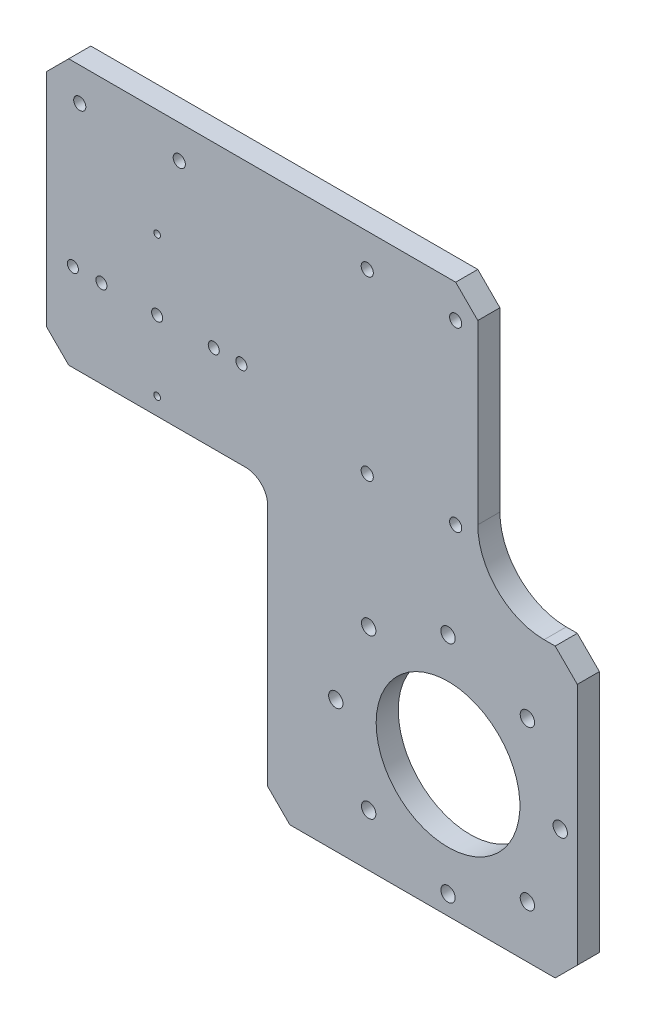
from build123d import *

# Parameters (mm, degrees)
ESQUISSE1_W                                        = 220
ESQUISSE1_H                                        = 250
BOSS_EXTRU_1_DEPTH                                 = 10
CHAMBRAGE_POUR_VIS_T_TE_HEXAGONALE_M61_D           = 6.6
CHAMBRAGE_POUR_VIS_T_TE_HEXAGONALE_M61_CBORE_D     = 11
CHAMBRAGE_POUR_VIS_T_TE_HEXAGONALE_M61_CBORE_DEPTH = 6.4
TROU_TARAUD_M61_D                                  = 5
DIAM_TRE_DU_PER_AGE_3_0_3_1_D                      = 3
ESQUISSE14_W                                       = 220
ESQUISSE14_H                                       = 10
BOSS_EXTRU_2_DEPTH                                 = 120
ESQUISSE15_W                                       = 220
ESQUISSE15_H                                       = 10
ENL_V_MAT_EXTRU_2_DEPTH                            = 120
ESQUISSE16_R                                       = 32.5
ENL_V_MAT_EXTRU_3_DEPTH                            = 120
ESQUISSE17_W                                       = 10
ESQUISSE17_H                                       = 250
BOSS_EXTRU_3_DEPTH                                 = 20
ESQUISSE18_W                                       = 100
ESQUISSE18_H                                       = 130
ENL_V_MAT_EXTRU_4_DEPTH                            = 278.533781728
CONG_1_R                                           = 10
CHANFREIN2_SIZE                                    = 10
ESQUISSE19_R                                       = 3.25
ENL_V_MAT_EXTRU_5_DEPTH                            = 10
ESQUISSE20_R                                       = 2.75
ENL_V_MAT_EXTRU_6_DEPTH                            = 10
TROU_TARAUD_M6X1_01_D                              = 5
ESQUISSE23_W                                       = 45
ESQUISSE23_H                                       = 120
ENL_V_MAT_EXTRU_7_DEPTH                            = 278.533781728
CONG_2_R                                           = 30
CHANFREIN3_SIZE                                    = 10


with BuildPart() as part:
    # Esquisse1 → Boss.-Extru.1 (new body)
    with BuildSketch(Plane.XY):
        Rectangle(ESQUISSE1_W, ESQUISSE1_H)
    extrude(amount=BOSS_EXTRU_1_DEPTH)

    # Chambrage pour vis _ t_te hexagonale M61 (through all)
    with Locations(Plane(origin=(0, 0, 0), x_dir=(-1, 0, 0), z_dir=(0, 0, -1))):
        with Locations((-103, 117.5), (-103, 42.5), (-3, 117.5), (-3, 42.5)):
            CounterBoreHole(CHAMBRAGE_POUR_VIS_T_TE_HEXAGONALE_M61_D / 2, CHAMBRAGE_POUR_VIS_T_TE_HEXAGONALE_M61_CBORE_D / 2, CHAMBRAGE_POUR_VIS_T_TE_HEXAGONALE_M61_CBORE_DEPTH)

    # Trou taraud_ M61 (through all)
    with Locations(Plane(origin=(0, 0, 0), x_dir=(-1, 0, 0), z_dir=(0, 0, -1))):
        with Locations((21.9, -75.4), (98.1, -75.4)):
            Hole(TROU_TARAUD_M61_D / 2)

    # Diam_tre du per_age _3.0 _3_1 (through all)
    with Locations(Plane(origin=(0, 0, 0), x_dir=(-1, 0, 0), z_dir=(0, 0, -1))):
        with Locations((60, -107.15), (60, -43.65)):
            Hole(DIAM_TRE_DU_PER_AGE_3_0_3_1_D / 2)

    # Esquisse14 → Boss.-Extru.2 (add)
    with BuildSketch(Plane.XZ.offset(125)):
        with Locations((0, 5)):
            Rectangle(ESQUISSE14_W, ESQUISSE14_H)
    extrude(amount=BOSS_EXTRU_2_DEPTH)

    # Esquisse15 → Enl_v. mat.-Extru.2 (cut)
    with BuildSketch(Plane(origin=(0, 125, 0), x_dir=(1, 0, 0), z_dir=(0, 1, 0))):
        with Locations((0, -5)):
            Rectangle(ESQUISSE15_W, ESQUISSE15_H)
    extrude(amount=-ENL_V_MAT_EXTRU_2_DEPTH, mode=Mode.SUBTRACT)

    # Esquisse16 → Enl_v. mat.-Extru.3 (cut)
    with BuildSketch(Plane(origin=(0, 0, 0), x_dir=(-1, 0, 0), z_dir=(0, 0, -1))):
        with Locations((-71.54, -185.54)):
            Circle(ESQUISSE16_R)
    extrude(amount=-ENL_V_MAT_EXTRU_3_DEPTH, mode=Mode.SUBTRACT)

    # Esquisse17 → Boss.-Extru.3 (add)
    with BuildSketch(Plane(origin=(110, 0, 0), x_dir=(0, 0, -1), z_dir=(1, 0, 0))):
        with Locations((-5, -120)):
            Rectangle(ESQUISSE17_W, ESQUISSE17_H)
    extrude(amount=BOSS_EXTRU_3_DEPTH)

    # Esquisse18 → Enl_v. mat.-Extru.4 (cut, through all)
    with BuildSketch(Plane(origin=(0, 0, 0), x_dir=(-1, 0, 0), z_dir=(0, 0, -1))):
        with Locations((60, -180)):
            Rectangle(ESQUISSE18_W, ESQUISSE18_H)
    extrude(amount=-ENL_V_MAT_EXTRU_4_DEPTH, mode=Mode.SUBTRACT)

    # Cong_1
    cong_1_edges = [part.edges().sort_by_distance(p)[0] for p in [
        (-10, -115, 5),
    ]]
    fillet(cong_1_edges, radius=CONG_1_R)

    # Chanfrein2
    chanfrein2_edges = [part.edges().sort_by_distance(p)[0] for p in [
        (130, 5, 5),
        (130, -245, 5),
        (-110, -115, 5),
        (-10, -245, 5),
        (-110, 5, 5),
    ]]
    chamfer(chanfrein2_edges, length=CHANFREIN2_SIZE)

    # Esquisse19 → Enl_v. mat.-Extru.5 (cut)
    with BuildSketch(Plane.XY.offset(10)):
        with Locations((35.654330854, -221.425669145)):
            Circle(ESQUISSE19_R)
        with Locations((71.54, -236.29)):
            Circle(ESQUISSE19_R)
        with Locations((122.29, -185.54)):
            Circle(ESQUISSE19_R)
        with Locations((107.425669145, -221.425669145)):
            Circle(ESQUISSE19_R)
        with Locations((71.54, -134.79)):
            Circle(ESQUISSE19_R)
        with Locations((35.654330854, -149.654330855)):
            Circle(ESQUISSE19_R)
        with Locations((20.79, -185.54)):
            Circle(ESQUISSE19_R)
        with Locations((107.425669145, -149.654330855)):
            Circle(ESQUISSE19_R)
    extrude(amount=-ENL_V_MAT_EXTRU_5_DEPTH, mode=Mode.SUBTRACT)

    # Esquisse20 → Enl_v. mat.-Extru.6 (cut)
    with BuildSketch(Plane(origin=(0, 0, 0), x_dir=(-1, 0, 0), z_dir=(0, 0, -1))):
        with Locations((-115, -10)):
            Circle(ESQUISSE20_R)
        with Locations((-75, -10)):
            Circle(ESQUISSE20_R)
        with Locations((-35, -10)):
            Circle(ESQUISSE20_R)
        with Locations((-35, -90)):
            Circle(ESQUISSE20_R)
        with Locations((-75, -90)):
            Circle(ESQUISSE20_R)
        with Locations((-115, -90)):
            Circle(ESQUISSE20_R)
        with Locations((95, -10)):
            Circle(ESQUISSE20_R)
        with Locations((50, -10)):
            Circle(ESQUISSE20_R)
    extrude(amount=-ENL_V_MAT_EXTRU_6_DEPTH, mode=Mode.SUBTRACT)

    # Trou taraud_ M6x1.01 (through all)
    with Locations(Plane(origin=(0, 0, 0), x_dir=(-1, 0, 0), z_dir=(0, 0, -1))):
        with Locations((85.2, -75.4), (60, -75.4), (34.4, -75.4)):
            Hole(TROU_TARAUD_M6X1_01_D / 2)

    # Esquisse23 → Enl_v. mat.-Extru.7 (cut, through all)
    with BuildSketch(Plane(origin=(0, 0, 0), x_dir=(-1, 0, 0), z_dir=(0, 0, -1))):
        with Locations((-107.5, -55)):
            Rectangle(ESQUISSE23_W, ESQUISSE23_H)
    extrude(amount=-ENL_V_MAT_EXTRU_7_DEPTH, mode=Mode.SUBTRACT)

    # Cong_2
    cong_2_edges = [part.edges().sort_by_distance(p)[0] for p in [
        (85, -115, 5),
    ]]
    fillet(cong_2_edges, radius=CONG_2_R)

    # Chanfrein3
    chanfrein3_edges = [part.edges().sort_by_distance(p)[0] for p in [
        (130, -115, 5),
        (85, 5, 5),
    ]]
    chamfer(chanfrein3_edges, length=CHANFREIN3_SIZE)


solid = part.part
